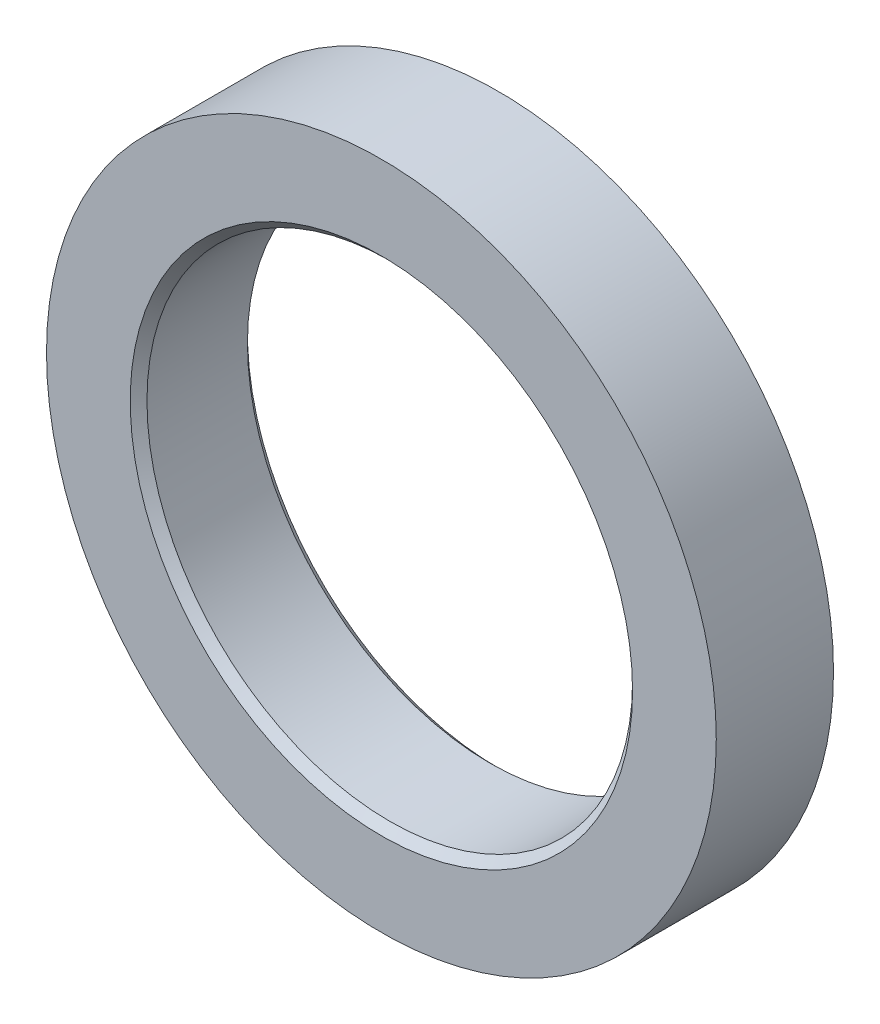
from build123d import *

# Parameters (mm, degrees)
SKETCH1_R      = 5.08
SKETCH1_R_2    = 3.683
EXTRUDE1_DEPTH = 1.778
CHAMFER1_SIZE  = 0.127


with BuildPart() as part:
    # Sketch1 → Extrude1 (new body)
    with BuildSketch(Plane.XY):
        Circle(SKETCH1_R)
        Circle(SKETCH1_R_2, mode=Mode.SUBTRACT)
    extrude(amount=EXTRUDE1_DEPTH)

    # Chamfer1
    chamfer1_edges = [part.edges().sort_by_distance(p)[0] for p in [
        (-3.683, 0, 0),
        (-3.683, 0, 1.778),
    ]]
    chamfer(chamfer1_edges, length=CHAMFER1_SIZE)


solid = part.part
